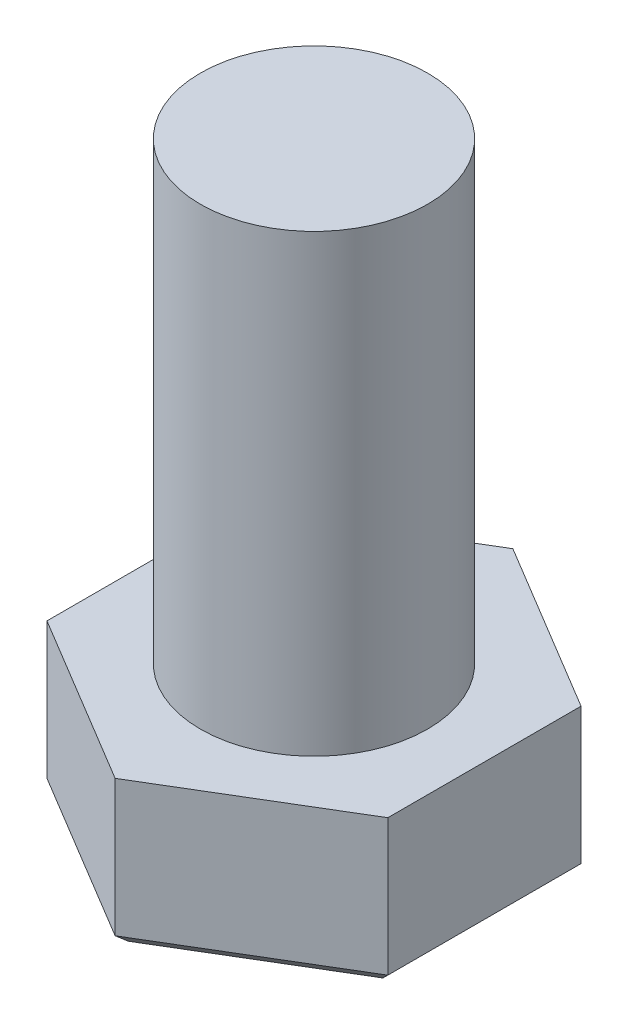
from build123d import *

# Parameters (mm, degrees)
ESQUISSE1_W      = 10
ESQUISSE1_H      = 40
EXTRUSION1_DEPTH = 13
CHANFREIN1_SIZE  = 1


with BuildPart() as part:
    # Esquisse1 → R_volution1 (revolve)
    with BuildSketch(Plane.XY, mode=Mode.PRIVATE) as r_volution1_sk:
        with Locations((5, 20)):
            Rectangle(ESQUISSE1_W, ESQUISSE1_H)
    revolve(r_volution1_sk.sketch.rotate(Axis((0, 40, 0), (0, -1, 0)), 180), axis=Axis((0, 40, 0), (0, -1, 0)))

    # Esquisse2 → Extrusion1 (add)
    with BuildSketch(Plane.XZ):
        Polygon((-15, -8.5), (-15, 8.5), (0, 17.5), (15, 8.5), (15, -8.5), (0, -17.5), align=None)
    extrude(amount=EXTRUSION1_DEPTH)

    # Chanfrein1
    chanfrein1_edges = [part.edges().sort_by_distance(p)[0] for p in [
        (7.5, -13, 13),
        (-7.5, -13, 13),
        (-15, -13, 0),
        (-7.5, -13, -13),
        (7.5, -13, -13),
        (15, -13, 0),
    ]]
    chamfer(chanfrein1_edges, length=CHANFREIN1_SIZE)


solid = part.part
